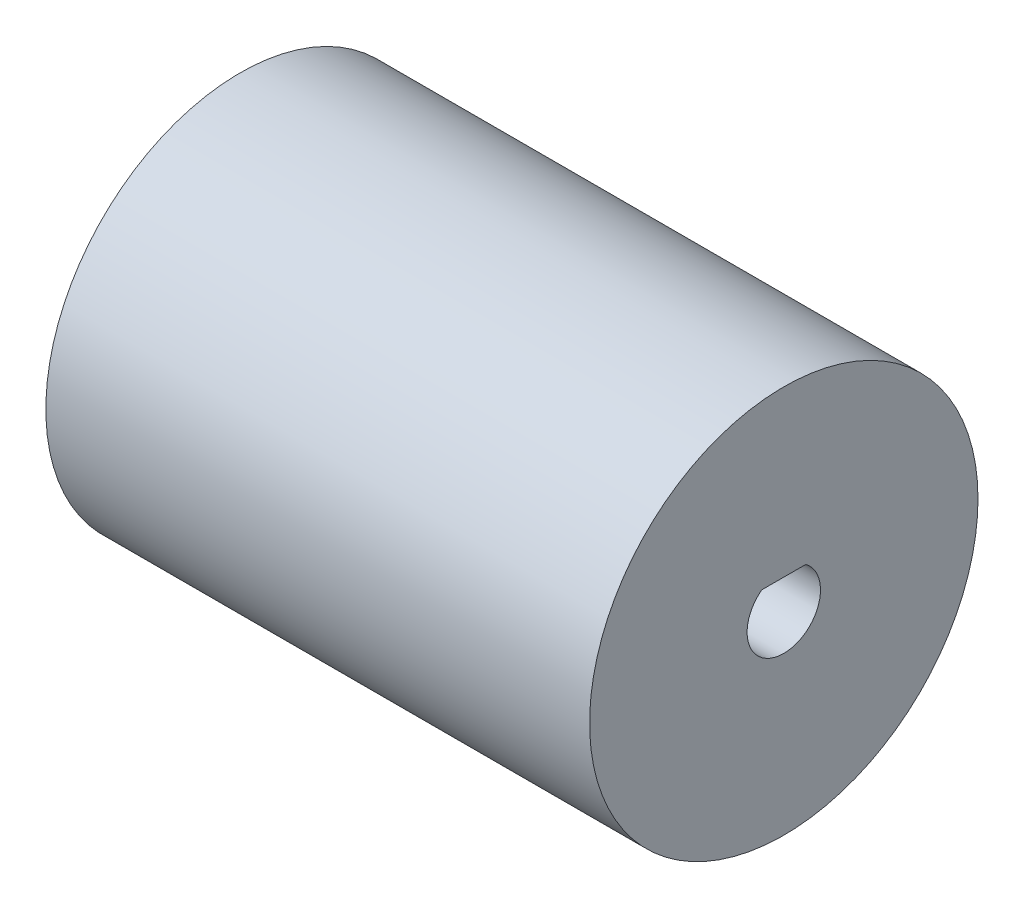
ISO-10303-21;
HEADER;
FILE_DESCRIPTION(('STEP AP214'),'2;1');
FILE_NAME('part.step','',(''),(''),'','','');
FILE_SCHEMA(('AUTOMOTIVE_DESIGN { 1 0 10303 214 1 1 1 1 }'));
ENDSEC;
DATA;
#1=APPLICATION_CONTEXT('core data for automotive mechanical design processes');
#2=APPLICATION_PROTOCOL_DEFINITION('international standard','automotive_design',2000,#1);
#3=PRODUCT_CONTEXT('',#1,'mechanical');
#4=PRODUCT('Part','Part','',(#3));
#5=PRODUCT_RELATED_PRODUCT_CATEGORY('part','',(#4));
#6=PRODUCT_DEFINITION_FORMATION('','',#4);
#7=PRODUCT_DEFINITION_CONTEXT('part definition',#1,'design');
#8=PRODUCT_DEFINITION('design','',#6,#7);
#9=PRODUCT_DEFINITION_SHAPE('','',#8);
#10=(LENGTH_UNIT() NAMED_UNIT(*) SI_UNIT(.MILLI.,.METRE.));
#11=(NAMED_UNIT(*) PLANE_ANGLE_UNIT() SI_UNIT($,.RADIAN.));
#12=(NAMED_UNIT(*) SI_UNIT($,.STERADIAN.) SOLID_ANGLE_UNIT());
#13=UNCERTAINTY_MEASURE_WITH_UNIT(LENGTH_MEASURE(1.E-05),#10,'distance_accuracy_value','');
#14=(GEOMETRIC_REPRESENTATION_CONTEXT(3) GLOBAL_UNCERTAINTY_ASSIGNED_CONTEXT((#13)) GLOBAL_UNIT_ASSIGNED_CONTEXT((#10,
#11,#12)) REPRESENTATION_CONTEXT('',''));
#15=CARTESIAN_POINT('',(0.,0.,0.));
#16=DIRECTION('',(0.,0.,1.));
#17=DIRECTION('',(1.,0.,0.));
#18=AXIS2_PLACEMENT_3D('',#15,#16,#17);
#19=CARTESIAN_POINT('',(22.225,0.,0.));
#20=DIRECTION('',(-1.,0.,0.));
#21=DIRECTION('',(0.,0.,1.));
#22=AXIS2_PLACEMENT_3D('',#19,#20,#21);
#23=CYLINDRICAL_SURFACE('',#22,7.9375);
#24=CARTESIAN_POINT('',(22.225,0.,0.));
#25=DIRECTION('',(1.,0.,0.));
#26=DIRECTION('',(0.,0.,-1.));
#27=AXIS2_PLACEMENT_3D('',#24,#25,#26);
#28=CIRCLE('',#27,7.9375);
#29=CARTESIAN_POINT('',(22.225,0.,-7.9375));
#30=VERTEX_POINT('',#29);
#31=EDGE_CURVE('E11',#30,#30,#28,.T.);
#32=ORIENTED_EDGE('',*,*,#31,.F.);
#33=EDGE_LOOP('',(#32));
#34=FACE_BOUND('',#33,.T.);
#35=CARTESIAN_POINT('',(0.,0.,0.));
#36=DIRECTION('',(1.,0.,0.));
#37=DIRECTION('',(0.,0.,-1.));
#38=AXIS2_PLACEMENT_3D('',#35,#36,#37);
#39=CIRCLE('',#38,7.9375);
#40=CARTESIAN_POINT('',(0.,0.,-7.9375));
#41=VERTEX_POINT('',#40);
#42=EDGE_CURVE('E34',#41,#41,#39,.T.);
#43=ORIENTED_EDGE('',*,*,#42,.T.);
#44=EDGE_LOOP('',(#43));
#45=FACE_BOUND('',#44,.T.);
#46=ADVANCED_FACE('F31',(#34,#45),#23,.T.);
#47=CARTESIAN_POINT('',(22.225,0.,0.));
#48=DIRECTION('',(1.,0.,0.));
#49=DIRECTION('',(0.,0.,-1.));
#50=AXIS2_PLACEMENT_3D('',#47,#48,#49);
#51=PLANE('',#50);
#52=CARTESIAN_POINT('',(22.225,0.,0.));
#53=DIRECTION('',(1.,0.,0.));
#54=DIRECTION('',(0.,0.,-1.));
#55=AXIS2_PLACEMENT_3D('',#52,#53,#54);
#56=CIRCLE('',#55,1.5);
#57=CARTESIAN_POINT('',(22.225,1.2,0.9));
#58=VERTEX_POINT('',#57);
#59=CARTESIAN_POINT('',(22.225,1.2,-0.9));
#60=VERTEX_POINT('',#59);
#61=EDGE_CURVE('E53',#58,#60,#56,.T.);
#62=ORIENTED_EDGE('',*,*,#61,.F.);
#63=DIRECTION('',(0.,0.,1.));
#64=VECTOR('',#63,1.);
#65=CARTESIAN_POINT('',(22.225,1.2,0.9));
#66=LINE('',#65,#64);
#67=EDGE_CURVE('E96',#60,#58,#66,.T.);
#68=ORIENTED_EDGE('',*,*,#67,.F.);
#69=EDGE_LOOP('',(#62,#68));
#70=FACE_BOUND('',#69,.T.);
#71=ORIENTED_EDGE('',*,*,#31,.T.);
#72=EDGE_LOOP('',(#71));
#73=FACE_BOUND('',#72,.T.);
#74=ADVANCED_FACE('F111',(#70,#73),#51,.T.);
#75=CARTESIAN_POINT('',(0.,0.,0.));
#76=DIRECTION('',(1.,0.,0.));
#77=DIRECTION('',(0.,0.,-1.));
#78=AXIS2_PLACEMENT_3D('',#75,#76,#77);
#79=PLANE('',#78);
#80=DIRECTION('',(0.,0.,-1.));
#81=VECTOR('',#80,1.);
#82=CARTESIAN_POINT('',(0.,2.54,-1.905));
#83=LINE('',#82,#81);
#84=CARTESIAN_POINT('',(0.,2.54,1.905));
#85=VERTEX_POINT('',#84);
#86=CARTESIAN_POINT('',(0.,2.54,-1.905));
#87=VERTEX_POINT('',#86);
#88=EDGE_CURVE('E85',#85,#87,#83,.T.);
#89=ORIENTED_EDGE('',*,*,#88,.F.);
#90=CARTESIAN_POINT('',(0.,0.,0.));
#91=DIRECTION('',(-1.,0.,0.));
#92=DIRECTION('',(0.,0.,1.));
#93=AXIS2_PLACEMENT_3D('',#90,#91,#92);
#94=CIRCLE('',#93,3.175);
#95=EDGE_CURVE('E45',#87,#85,#94,.T.);
#96=ORIENTED_EDGE('',*,*,#95,.F.);
#97=EDGE_LOOP('',(#89,#96));
#98=FACE_BOUND('',#97,.T.);
#99=ORIENTED_EDGE('',*,*,#42,.F.);
#100=EDGE_LOOP('',(#99));
#101=FACE_BOUND('',#100,.T.);
#102=ADVANCED_FACE('F114',(#98,#101),#79,.F.);
#103=CARTESIAN_POINT('',(11.1125,0.,0.));
#104=DIRECTION('',(1.,0.,0.));
#105=DIRECTION('',(0.,0.,-1.));
#106=AXIS2_PLACEMENT_3D('',#103,#104,#105);
#107=CYLINDRICAL_SURFACE('',#106,1.5);
#108=ORIENTED_EDGE('',*,*,#61,.T.);
#109=DIRECTION('',(1.,0.,0.));
#110=VECTOR('',#109,1.);
#111=CARTESIAN_POINT('',(11.1125,1.2,-0.9));
#112=LINE('',#111,#110);
#113=CARTESIAN_POINT('',(11.1125,1.2,-0.9));
#114=VERTEX_POINT('',#113);
#115=EDGE_CURVE('E98',#114,#60,#112,.T.);
#116=ORIENTED_EDGE('',*,*,#115,.F.);
#117=CARTESIAN_POINT('',(11.1125,0.,0.));
#118=DIRECTION('',(1.,0.,0.));
#119=DIRECTION('',(0.,0.,-1.));
#120=AXIS2_PLACEMENT_3D('',#117,#118,#119);
#121=CIRCLE('',#120,1.5);
#122=CARTESIAN_POINT('',(11.1125,1.2,0.9));
#123=VERTEX_POINT('',#122);
#124=EDGE_CURVE('E93',#123,#114,#121,.T.);
#125=ORIENTED_EDGE('',*,*,#124,.F.);
#126=DIRECTION('',(1.,0.,0.));
#127=VECTOR('',#126,1.);
#128=CARTESIAN_POINT('',(11.1125,1.2,0.9));
#129=LINE('',#128,#127);
#130=EDGE_CURVE('E102',#123,#58,#129,.T.);
#131=ORIENTED_EDGE('',*,*,#130,.T.);
#132=EDGE_LOOP('',(#108,#116,#125,#131));
#133=FACE_BOUND('',#132,.T.);
#134=ADVANCED_FACE('F124',(#133),#107,.F.);
#135=CARTESIAN_POINT('',(11.1125,1.2,0.9));
#136=DIRECTION('',(0.,1.,0.));
#137=DIRECTION('',(0.,0.,1.));
#138=AXIS2_PLACEMENT_3D('',#135,#136,#137);
#139=PLANE('',#138);
#140=ORIENTED_EDGE('',*,*,#67,.T.);
#141=ORIENTED_EDGE('',*,*,#130,.F.);
#142=DIRECTION('',(0.,0.,1.));
#143=VECTOR('',#142,1.);
#144=CARTESIAN_POINT('',(11.1125,1.2,0.9));
#145=LINE('',#144,#143);
#146=EDGE_CURVE('E95',#114,#123,#145,.T.);
#147=ORIENTED_EDGE('',*,*,#146,.F.);
#148=ORIENTED_EDGE('',*,*,#115,.T.);
#149=EDGE_LOOP('',(#140,#141,#147,#148));
#150=FACE_BOUND('',#149,.T.);
#151=ADVANCED_FACE('F107',(#150),#139,.F.);
#152=CARTESIAN_POINT('',(11.1125,0.,0.));
#153=DIRECTION('',(-1.,0.,0.));
#154=DIRECTION('',(0.,0.,1.));
#155=AXIS2_PLACEMENT_3D('',#152,#153,#154);
#156=PLANE('',#155);
#157=CARTESIAN_POINT('',(11.1125,0.,0.));
#158=DIRECTION('',(-1.,0.,0.));
#159=DIRECTION('',(0.,0.,1.));
#160=AXIS2_PLACEMENT_3D('',#157,#158,#159);
#161=CIRCLE('',#160,3.175);
#162=CARTESIAN_POINT('',(11.1125,2.54,-1.905));
#163=VERTEX_POINT('',#162);
#164=CARTESIAN_POINT('',(11.1125,2.54,1.905));
#165=VERTEX_POINT('',#164);
#166=EDGE_CURVE('E73',#163,#165,#161,.T.);
#167=ORIENTED_EDGE('',*,*,#166,.T.);
#168=DIRECTION('',(0.,0.,-1.));
#169=VECTOR('',#168,1.);
#170=CARTESIAN_POINT('',(11.1125,2.54,-1.905));
#171=LINE('',#170,#169);
#172=EDGE_CURVE('E80',#165,#163,#171,.T.);
#173=ORIENTED_EDGE('',*,*,#172,.T.);
#174=EDGE_LOOP('',(#167,#173));
#175=FACE_BOUND('',#174,.T.);
#176=ORIENTED_EDGE('',*,*,#124,.T.);
#177=ORIENTED_EDGE('',*,*,#146,.T.);
#178=EDGE_LOOP('',(#176,#177));
#179=FACE_BOUND('',#178,.T.);
#180=ADVANCED_FACE('F83',(#175,#179),#156,.T.);
#181=CARTESIAN_POINT('',(11.1125,0.,0.));
#182=DIRECTION('',(-1.,0.,0.));
#183=DIRECTION('',(0.,0.,1.));
#184=AXIS2_PLACEMENT_3D('',#181,#182,#183);
#185=CYLINDRICAL_SURFACE('',#184,3.175);
#186=ORIENTED_EDGE('',*,*,#95,.T.);
#187=DIRECTION('',(-1.,0.,0.));
#188=VECTOR('',#187,1.);
#189=CARTESIAN_POINT('',(11.1125,2.54,1.905));
#190=LINE('',#189,#188);
#191=EDGE_CURVE('E70',#165,#85,#190,.T.);
#192=ORIENTED_EDGE('',*,*,#191,.F.);
#193=ORIENTED_EDGE('',*,*,#166,.F.);
#194=DIRECTION('',(-1.,0.,0.));
#195=VECTOR('',#194,1.);
#196=CARTESIAN_POINT('',(11.1125,2.54,-1.905));
#197=LINE('',#196,#195);
#198=EDGE_CURVE('E79',#163,#87,#197,.T.);
#199=ORIENTED_EDGE('',*,*,#198,.T.);
#200=EDGE_LOOP('',(#186,#192,#193,#199));
#201=FACE_BOUND('',#200,.T.);
#202=ADVANCED_FACE('F72',(#201),#185,.F.);
#203=CARTESIAN_POINT('',(11.1125,2.54,-1.905));
#204=DIRECTION('',(0.,1.,0.));
#205=DIRECTION('',(0.,0.,1.));
#206=AXIS2_PLACEMENT_3D('',#203,#204,#205);
#207=PLANE('',#206);
#208=ORIENTED_EDGE('',*,*,#88,.T.);
#209=ORIENTED_EDGE('',*,*,#198,.F.);
#210=ORIENTED_EDGE('',*,*,#172,.F.);
#211=ORIENTED_EDGE('',*,*,#191,.T.);
#212=EDGE_LOOP('',(#208,#209,#210,#211));
#213=FACE_BOUND('',#212,.T.);
#214=ADVANCED_FACE('F87',(#213),#207,.F.);
#215=CLOSED_SHELL('',(#46,#74,#102,#134,#151,#180,#202,#214));
#216=MANIFOLD_SOLID_BREP('B2',#215);
#217=ADVANCED_BREP_SHAPE_REPRESENTATION('',(#18,#216),#14);
#218=SHAPE_DEFINITION_REPRESENTATION(#9,#217);
ENDSEC;
END-ISO-10303-21;
